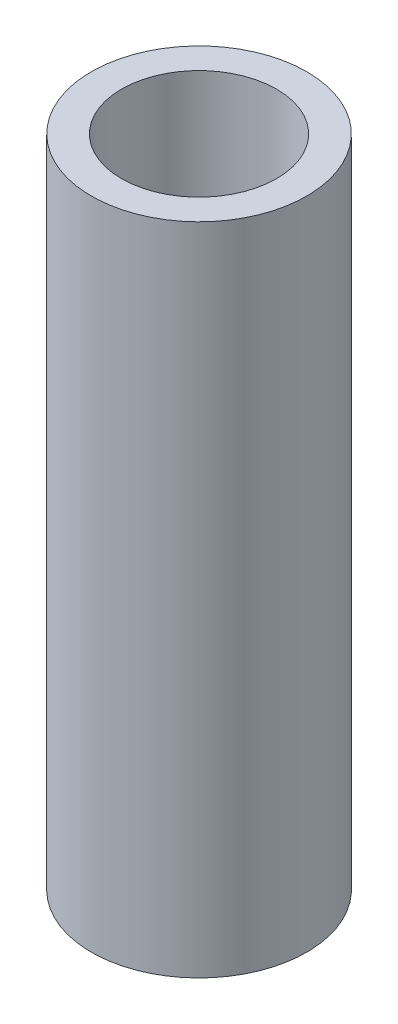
ISO-10303-21;
HEADER;
FILE_DESCRIPTION(('STEP AP214'),'2;1');
FILE_NAME('part.step','',(''),(''),'','','');
FILE_SCHEMA(('AUTOMOTIVE_DESIGN { 1 0 10303 214 1 1 1 1 }'));
ENDSEC;
DATA;
#1=APPLICATION_CONTEXT('core data for automotive mechanical design processes');
#2=APPLICATION_PROTOCOL_DEFINITION('international standard','automotive_design',2000,#1);
#3=PRODUCT_CONTEXT('',#1,'mechanical');
#4=PRODUCT('Part','Part','',(#3));
#5=PRODUCT_RELATED_PRODUCT_CATEGORY('part','',(#4));
#6=PRODUCT_DEFINITION_FORMATION('','',#4);
#7=PRODUCT_DEFINITION_CONTEXT('part definition',#1,'design');
#8=PRODUCT_DEFINITION('design','',#6,#7);
#9=PRODUCT_DEFINITION_SHAPE('','',#8);
#10=(LENGTH_UNIT() NAMED_UNIT(*) SI_UNIT(.MILLI.,.METRE.));
#11=(NAMED_UNIT(*) PLANE_ANGLE_UNIT() SI_UNIT($,.RADIAN.));
#12=(NAMED_UNIT(*) SI_UNIT($,.STERADIAN.) SOLID_ANGLE_UNIT());
#13=UNCERTAINTY_MEASURE_WITH_UNIT(LENGTH_MEASURE(1.E-05),#10,'distance_accuracy_value','');
#14=(GEOMETRIC_REPRESENTATION_CONTEXT(3) GLOBAL_UNCERTAINTY_ASSIGNED_CONTEXT((#13)) GLOBAL_UNIT_ASSIGNED_CONTEXT((#10,
#11,#12)) REPRESENTATION_CONTEXT('',''));
#15=CARTESIAN_POINT('',(0.,0.,0.));
#16=DIRECTION('',(0.,0.,1.));
#17=DIRECTION('',(1.,0.,0.));
#18=AXIS2_PLACEMENT_3D('',#15,#16,#17);
#19=CARTESIAN_POINT('',(0.,28.2842561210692,0.));
#20=DIRECTION('',(0.,-1.,0.));
#21=DIRECTION('',(0.,0.,-1.));
#22=AXIS2_PLACEMENT_3D('',#19,#20,#21);
#23=CYLINDRICAL_SURFACE('',#22,3.175);
#24=CARTESIAN_POINT('',(0.,0.,0.));
#25=DIRECTION('',(0.,1.,0.));
#26=DIRECTION('',(0.,0.,1.));
#27=AXIS2_PLACEMENT_3D('',#24,#25,#26);
#28=CIRCLE('',#27,3.175);
#29=CARTESIAN_POINT('',(0.,0.,-3.175));
#30=VERTEX_POINT('',#29);
#31=EDGE_CURVE('E40',#30,#30,#28,.T.);
#32=CARTESIAN_POINT('',(0.,19.304,0.));
#33=DIRECTION('',(0.,1.,0.));
#34=DIRECTION('',(0.,0.,1.));
#35=AXIS2_PLACEMENT_3D('',#32,#33,#34);
#36=CIRCLE('',#35,3.175);
#37=CARTESIAN_POINT('',(0.,19.304,-3.175));
#38=VERTEX_POINT('',#37);
#39=EDGE_CURVE('E10',#38,#38,#36,.T.);
#40=CARTESIAN_POINT('',(0.,0.,-3.175));
#41=CARTESIAN_POINT('',(0.,0.20108333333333,-3.175));
#42=CARTESIAN_POINT('',(0.,0.402166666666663,-3.175));
#43=CARTESIAN_POINT('',(0.,0.804333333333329,-3.175));
#44=CARTESIAN_POINT('',(0.,1.00541666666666,-3.175));
#45=CARTESIAN_POINT('',(0.,1.40758333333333,-3.175));
#46=CARTESIAN_POINT('',(0.,1.60866666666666,-3.175));
#47=CARTESIAN_POINT('',(0.,2.01083333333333,-3.175));
#48=CARTESIAN_POINT('',(0.,2.21191666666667,-3.175));
#49=CARTESIAN_POINT('',(0.,2.61408333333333,-3.175));
#50=CARTESIAN_POINT('',(0.,2.81516666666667,-3.175));
#51=CARTESIAN_POINT('',(0.,3.21733333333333,-3.175));
#52=CARTESIAN_POINT('',(0.,3.41841666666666,-3.175));
#53=CARTESIAN_POINT('',(0.,3.82058333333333,-3.175));
#54=CARTESIAN_POINT('',(0.,4.02166666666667,-3.175));
#55=CARTESIAN_POINT('',(0.,4.42383333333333,-3.175));
#56=CARTESIAN_POINT('',(0.,4.62491666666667,-3.175));
#57=CARTESIAN_POINT('',(0.,5.02708333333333,-3.175));
#58=CARTESIAN_POINT('',(0.,5.22816666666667,-3.175));
#59=CARTESIAN_POINT('',(0.,5.63033333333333,-3.175));
#60=CARTESIAN_POINT('',(0.,5.83141666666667,-3.175));
#61=CARTESIAN_POINT('',(0.,6.23358333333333,-3.175));
#62=CARTESIAN_POINT('',(0.,6.43466666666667,-3.175));
#63=CARTESIAN_POINT('',(0.,6.83683333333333,-3.175));
#64=CARTESIAN_POINT('',(0.,7.03791666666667,-3.175));
#65=CARTESIAN_POINT('',(0.,7.44008333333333,-3.175));
#66=CARTESIAN_POINT('',(0.,7.64116666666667,-3.175));
#67=CARTESIAN_POINT('',(0.,8.04333333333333,-3.175));
#68=CARTESIAN_POINT('',(0.,8.24441666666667,-3.175));
#69=CARTESIAN_POINT('',(0.,8.64658333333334,-3.175));
#70=CARTESIAN_POINT('',(0.,8.84766666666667,-3.175));
#71=CARTESIAN_POINT('',(0.,9.24983333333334,-3.175));
#72=CARTESIAN_POINT('',(0.,9.45091666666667,-3.175));
#73=CARTESIAN_POINT('',(0.,9.85308333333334,-3.175));
#74=CARTESIAN_POINT('',(0.,10.0541666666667,-3.175));
#75=CARTESIAN_POINT('',(0.,10.4563333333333,-3.175));
#76=CARTESIAN_POINT('',(0.,10.6574166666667,-3.175));
#77=CARTESIAN_POINT('',(0.,11.0595833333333,-3.175));
#78=CARTESIAN_POINT('',(0.,11.2606666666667,-3.175));
#79=CARTESIAN_POINT('',(0.,11.6628333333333,-3.175));
#80=CARTESIAN_POINT('',(0.,11.8639166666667,-3.175));
#81=CARTESIAN_POINT('',(0.,12.2660833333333,-3.175));
#82=CARTESIAN_POINT('',(0.,12.4671666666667,-3.175));
#83=CARTESIAN_POINT('',(0.,12.8693333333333,-3.175));
#84=CARTESIAN_POINT('',(0.,13.0704166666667,-3.175));
#85=CARTESIAN_POINT('',(0.,13.4725833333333,-3.175));
#86=CARTESIAN_POINT('',(0.,13.6736666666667,-3.175));
#87=CARTESIAN_POINT('',(0.,14.0758333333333,-3.175));
#88=CARTESIAN_POINT('',(0.,14.2769166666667,-3.175));
#89=CARTESIAN_POINT('',(0.,14.6790833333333,-3.175));
#90=CARTESIAN_POINT('',(0.,14.8801666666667,-3.175));
#91=CARTESIAN_POINT('',(0.,15.2823333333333,-3.175));
#92=CARTESIAN_POINT('',(0.,15.4834166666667,-3.175));
#93=CARTESIAN_POINT('',(0.,15.8855833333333,-3.175));
#94=CARTESIAN_POINT('',(0.,16.0866666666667,-3.175));
#95=CARTESIAN_POINT('',(0.,16.4888333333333,-3.175));
#96=CARTESIAN_POINT('',(0.,16.6899166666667,-3.175));
#97=CARTESIAN_POINT('',(0.,17.0920833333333,-3.175));
#98=CARTESIAN_POINT('',(0.,17.2931666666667,-3.175));
#99=CARTESIAN_POINT('',(0.,17.6953333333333,-3.175));
#100=CARTESIAN_POINT('',(0.,17.8964166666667,-3.175));
#101=CARTESIAN_POINT('',(0.,18.2985833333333,-3.175));
#102=CARTESIAN_POINT('',(0.,18.4996666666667,-3.175));
#103=CARTESIAN_POINT('',(0.,18.9018333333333,-3.175));
#104=CARTESIAN_POINT('',(0.,19.1029166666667,-3.175));
#105=CARTESIAN_POINT('',(0.,19.304,-3.175));
#106=B_SPLINE_CURVE_WITH_KNOTS('',3,(#40,#41,#42,#43,#44,#45,#46,#47,#48,#49,#50,#51,#52,#53,
#54,#55,#56,#57,#58,#59,#60,#61,#62,#63,#64,#65,#66,#67,#68,#69,#70,#71,#72,#73,#74,#75,#76,#77,
#78,#79,#80,#81,#82,#83,#84,#85,#86,#87,#88,#89,#90,#91,#92,#93,#94,#95,#96,#97,#98,#99,#100,
#101,#102,#103,#104,#105),.UNSPECIFIED.,.F.,.F.,(4,2,2,2,2,2,2,2,2,2,2,2,2,2,2,2,2,2,2,2,2,2,2,
2,2,2,2,2,2,2,2,2,4),(0.,0.60325,1.2065,1.80975,2.413,3.01625,3.6195,4.22275,4.826,5.42925,
6.0325,6.63575,7.239,7.84225000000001,8.4455,9.04875000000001,9.65200000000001,10.25525,10.8585,
11.46175,12.065,12.66825,13.2715,13.87475,14.478,15.08125,15.6845,16.28775,16.891,17.49425,
18.0975,18.70075,19.304),.UNSPECIFIED.);
#107=EDGE_CURVE('BSEAM33',#30,#38,#106,.T.);
#108=ORIENTED_EDGE('',*,*,#31,.T.);
#109=ORIENTED_EDGE('',*,*,#39,.F.);
#110=ORIENTED_EDGE('',*,*,#107,.T.);
#111=ORIENTED_EDGE('',*,*,#107,.F.);
#112=EDGE_LOOP('',(#108,#110,#109,#111));
#113=FACE_BOUND('',#112,.T.);
#114=ADVANCED_FACE('F33',(#113),#23,.T.);
#115=CARTESIAN_POINT('',(0.,0.,0.));
#116=DIRECTION('',(0.,1.,0.));
#117=DIRECTION('',(0.,0.,1.));
#118=AXIS2_PLACEMENT_3D('',#115,#116,#117);
#119=PLANE('',#118);
#120=ORIENTED_EDGE('',*,*,#31,.F.);
#121=EDGE_LOOP('',(#120));
#122=FACE_BOUND('',#121,.T.);
#123=CARTESIAN_POINT('',(0.,0.,0.));
#124=DIRECTION('',(0.,1.,0.));
#125=DIRECTION('',(0.,0.,1.));
#126=AXIS2_PLACEMENT_3D('',#123,#124,#125);
#127=CIRCLE('',#126,2.286);
#128=CARTESIAN_POINT('',(0.,0.,-2.286));
#129=VERTEX_POINT('',#128);
#130=EDGE_CURVE('E45',#129,#129,#127,.T.);
#131=ORIENTED_EDGE('',*,*,#130,.T.);
#132=EDGE_LOOP('',(#131));
#133=FACE_BOUND('',#132,.T.);
#134=ADVANCED_FACE('F61',(#122,#133),#119,.F.);
#135=CARTESIAN_POINT('',(0.,28.2842561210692,0.));
#136=DIRECTION('',(0.,-1.,0.));
#137=DIRECTION('',(0.,0.,-1.));
#138=AXIS2_PLACEMENT_3D('',#135,#136,#137);
#139=CYLINDRICAL_SURFACE('',#138,2.286);
#140=CARTESIAN_POINT('',(0.,19.304,0.));
#141=DIRECTION('',(0.,1.,0.));
#142=DIRECTION('',(0.,0.,1.));
#143=AXIS2_PLACEMENT_3D('',#140,#141,#142);
#144=CIRCLE('',#143,2.286);
#145=CARTESIAN_POINT('',(0.,19.304,-2.286));
#146=VERTEX_POINT('',#145);
#147=EDGE_CURVE('E36',#146,#146,#144,.T.);
#148=CARTESIAN_POINT('',(0.,0.,-2.286));
#149=CARTESIAN_POINT('',(0.,0.20108333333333,-2.286));
#150=CARTESIAN_POINT('',(0.,0.402166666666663,-2.286));
#151=CARTESIAN_POINT('',(0.,0.804333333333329,-2.286));
#152=CARTESIAN_POINT('',(0.,1.00541666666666,-2.286));
#153=CARTESIAN_POINT('',(0.,1.40758333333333,-2.286));
#154=CARTESIAN_POINT('',(0.,1.60866666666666,-2.286));
#155=CARTESIAN_POINT('',(0.,2.01083333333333,-2.286));
#156=CARTESIAN_POINT('',(0.,2.21191666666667,-2.286));
#157=CARTESIAN_POINT('',(0.,2.61408333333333,-2.286));
#158=CARTESIAN_POINT('',(0.,2.81516666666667,-2.286));
#159=CARTESIAN_POINT('',(0.,3.21733333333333,-2.286));
#160=CARTESIAN_POINT('',(0.,3.41841666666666,-2.286));
#161=CARTESIAN_POINT('',(0.,3.82058333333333,-2.286));
#162=CARTESIAN_POINT('',(0.,4.02166666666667,-2.286));
#163=CARTESIAN_POINT('',(0.,4.42383333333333,-2.286));
#164=CARTESIAN_POINT('',(0.,4.62491666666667,-2.286));
#165=CARTESIAN_POINT('',(0.,5.02708333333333,-2.286));
#166=CARTESIAN_POINT('',(0.,5.22816666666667,-2.286));
#167=CARTESIAN_POINT('',(0.,5.63033333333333,-2.286));
#168=CARTESIAN_POINT('',(0.,5.83141666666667,-2.286));
#169=CARTESIAN_POINT('',(0.,6.23358333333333,-2.286));
#170=CARTESIAN_POINT('',(0.,6.43466666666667,-2.286));
#171=CARTESIAN_POINT('',(0.,6.83683333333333,-2.286));
#172=CARTESIAN_POINT('',(0.,7.03791666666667,-2.286));
#173=CARTESIAN_POINT('',(0.,7.44008333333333,-2.286));
#174=CARTESIAN_POINT('',(0.,7.64116666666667,-2.286));
#175=CARTESIAN_POINT('',(0.,8.04333333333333,-2.286));
#176=CARTESIAN_POINT('',(0.,8.24441666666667,-2.286));
#177=CARTESIAN_POINT('',(0.,8.64658333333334,-2.286));
#178=CARTESIAN_POINT('',(0.,8.84766666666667,-2.286));
#179=CARTESIAN_POINT('',(0.,9.24983333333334,-2.286));
#180=CARTESIAN_POINT('',(0.,9.45091666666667,-2.286));
#181=CARTESIAN_POINT('',(0.,9.85308333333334,-2.286));
#182=CARTESIAN_POINT('',(0.,10.0541666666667,-2.286));
#183=CARTESIAN_POINT('',(0.,10.4563333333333,-2.286));
#184=CARTESIAN_POINT('',(0.,10.6574166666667,-2.286));
#185=CARTESIAN_POINT('',(0.,11.0595833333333,-2.286));
#186=CARTESIAN_POINT('',(0.,11.2606666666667,-2.286));
#187=CARTESIAN_POINT('',(0.,11.6628333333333,-2.286));
#188=CARTESIAN_POINT('',(0.,11.8639166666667,-2.286));
#189=CARTESIAN_POINT('',(0.,12.2660833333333,-2.286));
#190=CARTESIAN_POINT('',(0.,12.4671666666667,-2.286));
#191=CARTESIAN_POINT('',(0.,12.8693333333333,-2.286));
#192=CARTESIAN_POINT('',(0.,13.0704166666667,-2.286));
#193=CARTESIAN_POINT('',(0.,13.4725833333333,-2.286));
#194=CARTESIAN_POINT('',(0.,13.6736666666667,-2.286));
#195=CARTESIAN_POINT('',(0.,14.0758333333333,-2.286));
#196=CARTESIAN_POINT('',(0.,14.2769166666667,-2.286));
#197=CARTESIAN_POINT('',(0.,14.6790833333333,-2.286));
#198=CARTESIAN_POINT('',(0.,14.8801666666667,-2.286));
#199=CARTESIAN_POINT('',(0.,15.2823333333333,-2.286));
#200=CARTESIAN_POINT('',(0.,15.4834166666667,-2.286));
#201=CARTESIAN_POINT('',(0.,15.8855833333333,-2.286));
#202=CARTESIAN_POINT('',(0.,16.0866666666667,-2.286));
#203=CARTESIAN_POINT('',(0.,16.4888333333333,-2.286));
#204=CARTESIAN_POINT('',(0.,16.6899166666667,-2.286));
#205=CARTESIAN_POINT('',(0.,17.0920833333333,-2.286));
#206=CARTESIAN_POINT('',(0.,17.2931666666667,-2.286));
#207=CARTESIAN_POINT('',(0.,17.6953333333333,-2.286));
#208=CARTESIAN_POINT('',(0.,17.8964166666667,-2.286));
#209=CARTESIAN_POINT('',(0.,18.2985833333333,-2.286));
#210=CARTESIAN_POINT('',(0.,18.4996666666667,-2.286));
#211=CARTESIAN_POINT('',(0.,18.9018333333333,-2.286));
#212=CARTESIAN_POINT('',(0.,19.1029166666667,-2.286));
#213=CARTESIAN_POINT('',(0.,19.304,-2.286));
#214=B_SPLINE_CURVE_WITH_KNOTS('',3,(#148,#149,#150,#151,#152,#153,#154,#155,#156,#157,#158,
#159,#160,#161,#162,#163,#164,#165,#166,#167,#168,#169,#170,#171,#172,#173,#174,#175,#176,#177,
#178,#179,#180,#181,#182,#183,#184,#185,#186,#187,#188,#189,#190,#191,#192,#193,#194,#195,#196,
#197,#198,#199,#200,#201,#202,#203,#204,#205,#206,#207,#208,#209,#210,#211,#212,#213),
.UNSPECIFIED.,.F.,.F.,(4,2,2,2,2,2,2,2,2,2,2,2,2,2,2,2,2,2,2,2,2,2,2,2,2,2,2,2,2,2,2,2,4),(0.,
0.60325,1.2065,1.80975,2.413,3.01625,3.6195,4.22275,4.826,5.42925,6.0325,6.63575,7.239,
7.84225000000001,8.4455,9.04875000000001,9.65200000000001,10.25525,10.8585,11.46175,12.065,
12.66825,13.2715,13.87475,14.478,15.08125,15.6845,16.28775,16.891,17.49425,18.0975,18.70075,
19.304),.UNSPECIFIED.);
#215=EDGE_CURVE('BSEAM53',#129,#146,#214,.T.);
#216=ORIENTED_EDGE('',*,*,#130,.F.);
#217=ORIENTED_EDGE('',*,*,#147,.T.);
#218=ORIENTED_EDGE('',*,*,#215,.T.);
#219=ORIENTED_EDGE('',*,*,#215,.F.);
#220=EDGE_LOOP('',(#216,#218,#217,#219));
#221=FACE_BOUND('',#220,.T.);
#222=ADVANCED_FACE('F53',(#221),#139,.F.);
#223=CARTESIAN_POINT('',(0.,19.304,0.));
#224=DIRECTION('',(0.,1.,0.));
#225=DIRECTION('',(0.0710874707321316,0.,0.997470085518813));
#226=AXIS2_PLACEMENT_3D('',#223,#224,#225);
#227=PLANE('',#226);
#228=ORIENTED_EDGE('',*,*,#147,.F.);
#229=EDGE_LOOP('',(#228));
#230=FACE_BOUND('',#229,.T.);
#231=ORIENTED_EDGE('',*,*,#39,.T.);
#232=EDGE_LOOP('',(#231));
#233=FACE_BOUND('',#232,.T.);
#234=ADVANCED_FACE('F55',(#230,#233),#227,.T.);
#235=CLOSED_SHELL('',(#114,#134,#222,#234));
#236=MANIFOLD_SOLID_BREP('B2',#235);
#237=ADVANCED_BREP_SHAPE_REPRESENTATION('',(#18,#236),#14);
#238=SHAPE_DEFINITION_REPRESENTATION(#9,#237);
ENDSEC;
END-ISO-10303-21;
